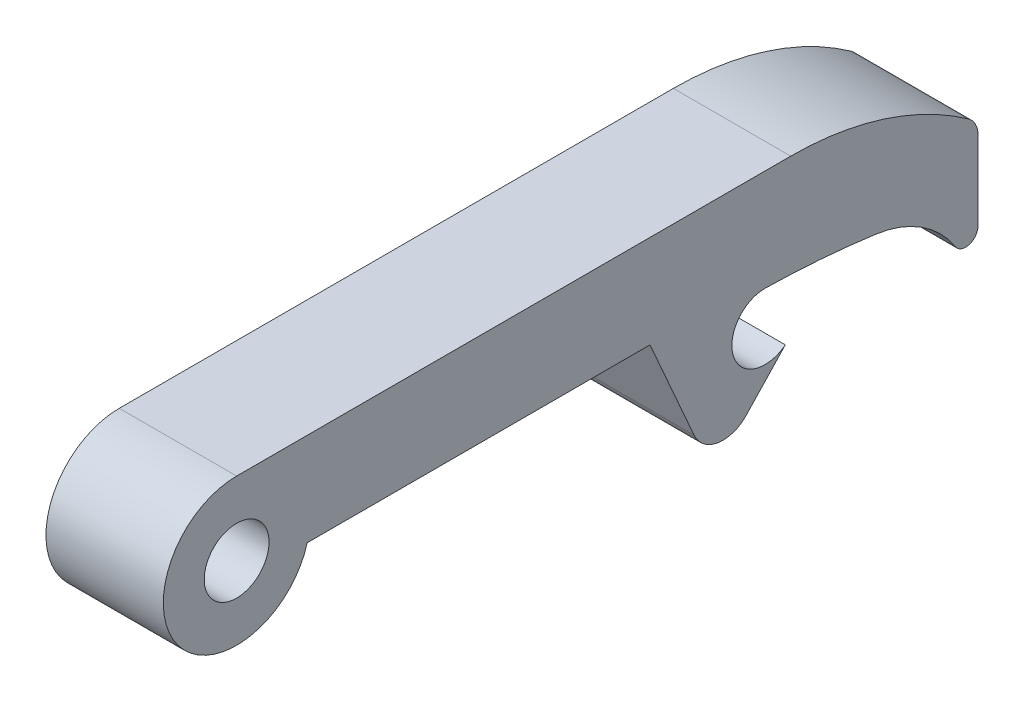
ISO-10303-21;
HEADER;
FILE_DESCRIPTION(('STEP AP214'),'2;1');
FILE_NAME('part.step','',(''),(''),'','','');
FILE_SCHEMA(('AUTOMOTIVE_DESIGN { 1 0 10303 214 1 1 1 1 }'));
ENDSEC;
DATA;
#1=APPLICATION_CONTEXT('core data for automotive mechanical design processes');
#2=APPLICATION_PROTOCOL_DEFINITION('international standard','automotive_design',2000,#1);
#3=PRODUCT_CONTEXT('',#1,'mechanical');
#4=PRODUCT('Part','Part','',(#3));
#5=PRODUCT_RELATED_PRODUCT_CATEGORY('part','',(#4));
#6=PRODUCT_DEFINITION_FORMATION('','',#4);
#7=PRODUCT_DEFINITION_CONTEXT('part definition',#1,'design');
#8=PRODUCT_DEFINITION('design','',#6,#7);
#9=PRODUCT_DEFINITION_SHAPE('','',#8);
#10=(LENGTH_UNIT() NAMED_UNIT(*) SI_UNIT(.MILLI.,.METRE.));
#11=(NAMED_UNIT(*) PLANE_ANGLE_UNIT() SI_UNIT($,.RADIAN.));
#12=(NAMED_UNIT(*) SI_UNIT($,.STERADIAN.) SOLID_ANGLE_UNIT());
#13=UNCERTAINTY_MEASURE_WITH_UNIT(LENGTH_MEASURE(1.E-05),#10,'distance_accuracy_value','');
#14=(GEOMETRIC_REPRESENTATION_CONTEXT(3) GLOBAL_UNCERTAINTY_ASSIGNED_CONTEXT((#13)) GLOBAL_UNIT_ASSIGNED_CONTEXT((#10,
#11,#12)) REPRESENTATION_CONTEXT('',''));
#15=CARTESIAN_POINT('',(0.,0.,0.));
#16=DIRECTION('',(0.,0.,1.));
#17=DIRECTION('',(1.,0.,0.));
#18=AXIS2_PLACEMENT_3D('',#15,#16,#17);
#19=CARTESIAN_POINT('',(31.75,-18.2904528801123,286.195239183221));
#20=DIRECTION('',(-1.,0.,0.));
#21=DIRECTION('',(0.,0.,1.));
#22=AXIS2_PLACEMENT_3D('',#19,#20,#21);
#23=CYLINDRICAL_SURFACE('',#22,39.6691923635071);
#24=CARTESIAN_POINT('',(-31.75,-18.2904528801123,286.195239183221));
#25=DIRECTION('',(1.,0.,0.));
#26=DIRECTION('',(0.,0.,-1.));
#27=AXIS2_PLACEMENT_3D('',#24,#25,#26);
#28=CIRCLE('',#27,39.6691923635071);
#29=CARTESIAN_POINT('',(-31.75,21.3787394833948,286.195239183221));
#30=VERTEX_POINT('',#29);
#31=CARTESIAN_POINT('',(-31.75,-28.9798226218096,247.99337800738));
#32=VERTEX_POINT('',#31);
#33=EDGE_CURVE('E127',#30,#32,#28,.T.);
#34=ORIENTED_EDGE('',*,*,#33,.T.);
#35=DIRECTION('',(-1.,0.,0.));
#36=VECTOR('',#35,1.);
#37=CARTESIAN_POINT('',(31.75,-28.9798226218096,247.99337800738));
#38=LINE('',#37,#36);
#39=CARTESIAN_POINT('',(31.75,-28.9798226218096,247.99337800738));
#40=VERTEX_POINT('',#39);
#41=EDGE_CURVE('E11',#40,#32,#38,.T.);
#42=ORIENTED_EDGE('',*,*,#41,.F.);
#43=CARTESIAN_POINT('',(31.75,-18.2904528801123,286.195239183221));
#44=DIRECTION('',(1.,0.,0.));
#45=DIRECTION('',(0.,0.,-1.));
#46=AXIS2_PLACEMENT_3D('',#43,#44,#45);
#47=CIRCLE('',#46,39.6691923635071);
#48=CARTESIAN_POINT('',(31.75,21.3787394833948,286.195239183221));
#49=VERTEX_POINT('',#48);
#50=EDGE_CURVE('E169',#49,#40,#47,.T.);
#51=ORIENTED_EDGE('',*,*,#50,.F.);
#52=DIRECTION('',(-1.,0.,0.));
#53=VECTOR('',#52,1.);
#54=CARTESIAN_POINT('',(31.75,21.3787394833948,286.195239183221));
#55=LINE('',#54,#53);
#56=EDGE_CURVE('E140',#49,#30,#55,.T.);
#57=ORIENTED_EDGE('',*,*,#56,.T.);
#58=EDGE_LOOP('',(#34,#42,#51,#57));
#59=FACE_BOUND('',#58,.T.);
#60=ADVANCED_FACE('F29',(#59),#23,.T.);
#61=CARTESIAN_POINT('',(31.75,-28.9798226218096,62.5236476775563));
#62=DIRECTION('',(0.,1.,0.));
#63=DIRECTION('',(0.,0.,1.));
#64=AXIS2_PLACEMENT_3D('',#61,#62,#63);
#65=PLANE('',#64);
#66=DIRECTION('',(0.,0.,-1.));
#67=VECTOR('',#66,1.);
#68=CARTESIAN_POINT('',(-31.75,-28.9798226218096,62.5236476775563));
#69=LINE('',#68,#67);
#70=CARTESIAN_POINT('',(-31.75,-28.9798226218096,62.5236476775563));
#71=VERTEX_POINT('',#70);
#72=EDGE_CURVE('E123',#32,#71,#69,.T.);
#73=ORIENTED_EDGE('',*,*,#72,.T.);
#74=DIRECTION('',(-1.,0.,0.));
#75=VECTOR('',#74,1.);
#76=CARTESIAN_POINT('',(31.75,-28.9798226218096,62.5236476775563));
#77=LINE('',#76,#75);
#78=CARTESIAN_POINT('',(31.75,-28.9798226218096,62.5236476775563));
#79=VERTEX_POINT('',#78);
#80=EDGE_CURVE('E36',#79,#71,#77,.T.);
#81=ORIENTED_EDGE('',*,*,#80,.F.);
#82=DIRECTION('',(0.,0.,-1.));
#83=VECTOR('',#82,1.);
#84=CARTESIAN_POINT('',(31.75,-28.9798226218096,62.5236476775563));
#85=LINE('',#84,#83);
#86=EDGE_CURVE('E136',#40,#79,#85,.T.);
#87=ORIENTED_EDGE('',*,*,#86,.F.);
#88=ORIENTED_EDGE('',*,*,#41,.T.);
#89=EDGE_LOOP('',(#73,#81,#87,#88));
#90=FACE_BOUND('',#89,.T.);
#91=ADVANCED_FACE('F135',(#90),#65,.F.);
#92=CARTESIAN_POINT('',(31.75,-83.2179374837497,38.6844172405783));
#93=DIRECTION('',(0.,0.40237741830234,-0.9154738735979));
#94=DIRECTION('',(0.,0.9154738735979,0.40237741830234));
#95=AXIS2_PLACEMENT_3D('',#92,#93,#94);
#96=PLANE('',#95);
#97=DIRECTION('',(0.,-0.9154738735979,-0.40237741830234));
#98=VECTOR('',#97,1.);
#99=CARTESIAN_POINT('',(-31.75,-83.2179374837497,38.6844172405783));
#100=LINE('',#99,#98);
#101=CARTESIAN_POINT('',(-31.75,-83.2179374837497,38.6844172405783));
#102=VERTEX_POINT('',#101);
#103=EDGE_CURVE('E129',#71,#102,#100,.T.);
#104=ORIENTED_EDGE('',*,*,#103,.T.);
#105=DIRECTION('',(-1.,0.,0.));
#106=VECTOR('',#105,1.);
#107=CARTESIAN_POINT('',(31.75,-83.2179374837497,38.6844172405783));
#108=LINE('',#107,#106);
#109=CARTESIAN_POINT('',(31.75,-83.2179374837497,38.6844172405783));
#110=VERTEX_POINT('',#109);
#111=EDGE_CURVE('E220',#110,#102,#108,.T.);
#112=ORIENTED_EDGE('',*,*,#111,.F.);
#113=DIRECTION('',(0.,-0.9154738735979,-0.40237741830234));
#114=VECTOR('',#113,1.);
#115=CARTESIAN_POINT('',(31.75,-83.2179374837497,38.6844172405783));
#116=LINE('',#115,#114);
#117=EDGE_CURVE('E172',#79,#110,#116,.T.);
#118=ORIENTED_EDGE('',*,*,#117,.F.);
#119=ORIENTED_EDGE('',*,*,#80,.T.);
#120=EDGE_LOOP('',(#104,#112,#118,#119));
#121=FACE_BOUND('',#120,.T.);
#122=ADVANCED_FACE('F224',(#121),#96,.F.);
#123=CARTESIAN_POINT('',(31.75,-76.3212880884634,22.9934215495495));
#124=DIRECTION('',(-1.,0.,0.));
#125=DIRECTION('',(0.,0.,1.));
#126=AXIS2_PLACEMENT_3D('',#123,#124,#125);
#127=CYLINDRICAL_SURFACE('',#126,17.1397525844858);
#128=CARTESIAN_POINT('',(-31.75,-76.3212880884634,22.9934215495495));
#129=DIRECTION('',(1.,0.,0.));
#130=DIRECTION('',(0.,0.,1.));
#131=AXIS2_PLACEMENT_3D('',#128,#129,#130);
#132=CIRCLE('',#131,17.1397525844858);
#133=CARTESIAN_POINT('',(-31.75,-88.0789591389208,10.5223233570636));
#134=VERTEX_POINT('',#133);
#135=EDGE_CURVE('E149',#102,#134,#132,.T.);
#136=ORIENTED_EDGE('',*,*,#135,.T.);
#137=DIRECTION('',(-1.,0.,0.));
#138=VECTOR('',#137,1.);
#139=CARTESIAN_POINT('',(31.75,-88.0789591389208,10.5223233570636));
#140=LINE('',#139,#138);
#141=CARTESIAN_POINT('',(31.75,-88.0789591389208,10.5223233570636));
#142=VERTEX_POINT('',#141);
#143=EDGE_CURVE('E217',#142,#134,#140,.T.);
#144=ORIENTED_EDGE('',*,*,#143,.F.);
#145=CARTESIAN_POINT('',(31.75,-76.3212880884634,22.9934215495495));
#146=DIRECTION('',(1.,0.,0.));
#147=DIRECTION('',(0.,0.,1.));
#148=AXIS2_PLACEMENT_3D('',#145,#146,#147);
#149=CIRCLE('',#148,17.1397525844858);
#150=EDGE_CURVE('E174',#110,#142,#149,.T.);
#151=ORIENTED_EDGE('',*,*,#150,.F.);
#152=ORIENTED_EDGE('',*,*,#111,.T.);
#153=EDGE_LOOP('',(#136,#144,#151,#152));
#154=FACE_BOUND('',#153,.T.);
#155=ADVANCED_FACE('F232',(#154),#127,.T.);
#156=CARTESIAN_POINT('',(31.75,-65.5801916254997,-10.6893697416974));
#157=DIRECTION('',(0.,0.685988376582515,0.727612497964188));
#158=DIRECTION('',(0.,-0.727612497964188,0.685988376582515));
#159=AXIS2_PLACEMENT_3D('',#156,#157,#158);
#160=PLANE('',#159);
#161=DIRECTION('',(0.,0.727612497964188,-0.685988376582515));
#162=VECTOR('',#161,1.);
#163=CARTESIAN_POINT('',(-31.75,-65.5801916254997,-10.6893697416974));
#164=LINE('',#163,#162);
#165=CARTESIAN_POINT('',(-31.75,-65.5801916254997,-10.6893697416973));
#166=VERTEX_POINT('',#165);
#167=EDGE_CURVE('E151',#134,#166,#164,.T.);
#168=ORIENTED_EDGE('',*,*,#167,.T.);
#169=DIRECTION('',(-1.,0.,0.));
#170=VECTOR('',#169,1.);
#171=CARTESIAN_POINT('',(31.75,-65.5801916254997,-10.6893697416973));
#172=LINE('',#171,#170);
#173=CARTESIAN_POINT('',(31.75,-65.5801916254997,-10.6893697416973));
#174=VERTEX_POINT('',#173);
#175=EDGE_CURVE('E214',#174,#166,#172,.T.);
#176=ORIENTED_EDGE('',*,*,#175,.F.);
#177=DIRECTION('',(0.,0.727612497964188,-0.685988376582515));
#178=VECTOR('',#177,1.);
#179=CARTESIAN_POINT('',(31.75,-65.5801916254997,-10.6893697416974));
#180=LINE('',#179,#178);
#181=EDGE_CURVE('E176',#142,#174,#180,.T.);
#182=ORIENTED_EDGE('',*,*,#181,.F.);
#183=ORIENTED_EDGE('',*,*,#143,.T.);
#184=EDGE_LOOP('',(#168,#176,#182,#183));
#185=FACE_BOUND('',#184,.T.);
#186=ADVANCED_FACE('F235',(#185),#160,.F.);
#187=CARTESIAN_POINT('',(31.75,-51.4973439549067,0.329066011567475));
#188=DIRECTION('',(-1.,0.,0.));
#189=DIRECTION('',(0.,0.,1.));
#190=AXIS2_PLACEMENT_3D('',#187,#188,#189);
#191=CYLINDRICAL_SURFACE('',#190,17.8810661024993);
#192=CARTESIAN_POINT('',(-31.75,-51.4973439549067,0.329066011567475));
#193=DIRECTION('',(-1.,0.,0.));
#194=DIRECTION('',(0.,0.,-1.));
#195=AXIS2_PLACEMENT_3D('',#192,#193,#194);
#196=CIRCLE('',#195,17.8810661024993);
#197=CARTESIAN_POINT('',(-31.75,-33.6193060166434,0.));
#198=VERTEX_POINT('',#197);
#199=EDGE_CURVE('E153',#166,#198,#196,.T.);
#200=ORIENTED_EDGE('',*,*,#199,.T.);
#201=DIRECTION('',(-1.,0.,0.));
#202=VECTOR('',#201,1.);
#203=CARTESIAN_POINT('',(31.75,-33.6193060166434,0.));
#204=LINE('',#203,#202);
#205=CARTESIAN_POINT('',(31.75,-33.6193060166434,0.));
#206=VERTEX_POINT('',#205);
#207=EDGE_CURVE('E211',#206,#198,#204,.T.);
#208=ORIENTED_EDGE('',*,*,#207,.F.);
#209=CARTESIAN_POINT('',(31.75,-51.4973439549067,0.329066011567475));
#210=DIRECTION('',(-1.,0.,0.));
#211=DIRECTION('',(0.,0.,-1.));
#212=AXIS2_PLACEMENT_3D('',#209,#210,#211);
#213=CIRCLE('',#212,17.8810661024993);
#214=EDGE_CURVE('E178',#174,#206,#213,.T.);
#215=ORIENTED_EDGE('',*,*,#214,.F.);
#216=ORIENTED_EDGE('',*,*,#175,.T.);
#217=EDGE_LOOP('',(#200,#208,#215,#216));
#218=FACE_BOUND('',#217,.T.);
#219=ADVANCED_FACE('F240',(#218),#191,.F.);
#220=CARTESIAN_POINT('',(31.75,-541.879675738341,9.35512125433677));
#221=DIRECTION('',(-1.,0.,0.));
#222=DIRECTION('',(0.,0.,1.));
#223=AXIS2_PLACEMENT_3D('',#220,#221,#222);
#224=CYLINDRICAL_SURFACE('',#223,508.346458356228);
#225=CARTESIAN_POINT('',(-31.75,-541.879675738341,9.35512125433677));
#226=DIRECTION('',(-1.,0.,0.));
#227=DIRECTION('',(0.,0.,-1.));
#228=AXIS2_PLACEMENT_3D('',#225,#226,#227);
#229=CIRCLE('',#228,508.346458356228);
#230=CARTESIAN_POINT('',(-31.75,-38.2587894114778,-59.7977859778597));
#231=VERTEX_POINT('',#230);
#232=EDGE_CURVE('E155',#198,#231,#229,.T.);
#233=ORIENTED_EDGE('',*,*,#232,.T.);
#234=DIRECTION('',(-1.,0.,0.));
#235=VECTOR('',#234,1.);
#236=CARTESIAN_POINT('',(31.75,-38.2587894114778,-59.7977859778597));
#237=LINE('',#236,#235);
#238=CARTESIAN_POINT('',(31.75,-38.2587894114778,-59.7977859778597));
#239=VERTEX_POINT('',#238);
#240=EDGE_CURVE('E208',#239,#231,#237,.T.);
#241=ORIENTED_EDGE('',*,*,#240,.F.);
#242=CARTESIAN_POINT('',(31.75,-541.879675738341,9.35512125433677));
#243=DIRECTION('',(-1.,0.,0.));
#244=DIRECTION('',(0.,0.,-1.));
#245=AXIS2_PLACEMENT_3D('',#242,#243,#244);
#246=CIRCLE('',#245,508.346458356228);
#247=EDGE_CURVE('E180',#206,#239,#246,.T.);
#248=ORIENTED_EDGE('',*,*,#247,.F.);
#249=ORIENTED_EDGE('',*,*,#207,.T.);
#250=EDGE_LOOP('',(#233,#241,#248,#249));
#251=FACE_BOUND('',#250,.T.);
#252=ADVANCED_FACE('F246',(#251),#224,.F.);
#253=CARTESIAN_POINT('',(31.75,-98.6662997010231,-51.503143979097));
#254=DIRECTION('',(-1.,0.,0.));
#255=DIRECTION('',(0.,0.,1.));
#256=AXIS2_PLACEMENT_3D('',#253,#254,#255);
#257=CYLINDRICAL_SURFACE('',#256,60.9743256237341);
#258=CARTESIAN_POINT('',(-31.75,-98.6662997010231,-51.503143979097));
#259=DIRECTION('',(-1.,0.,0.));
#260=DIRECTION('',(0.,0.,-1.));
#261=AXIS2_PLACEMENT_3D('',#258,#259,#260);
#262=CIRCLE('',#261,60.9743256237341);
#263=CARTESIAN_POINT('',(-31.75,-65.5801916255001,-102.720112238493));
#264=VERTEX_POINT('',#263);
#265=EDGE_CURVE('E157',#231,#264,#262,.T.);
#266=ORIENTED_EDGE('',*,*,#265,.T.);
#267=DIRECTION('',(-1.,0.,0.));
#268=VECTOR('',#267,1.);
#269=CARTESIAN_POINT('',(31.75,-65.5801916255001,-102.720112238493));
#270=LINE('',#269,#268);
#271=CARTESIAN_POINT('',(31.75,-65.5801916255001,-102.720112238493));
#272=VERTEX_POINT('',#271);
#273=EDGE_CURVE('E205',#272,#264,#270,.T.);
#274=ORIENTED_EDGE('',*,*,#273,.F.);
#275=CARTESIAN_POINT('',(31.75,-98.6662997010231,-51.503143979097));
#276=DIRECTION('',(-1.,0.,0.));
#277=DIRECTION('',(0.,0.,-1.));
#278=AXIS2_PLACEMENT_3D('',#275,#276,#277);
#279=CIRCLE('',#278,60.9743256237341);
#280=EDGE_CURVE('E182',#239,#272,#279,.T.);
#281=ORIENTED_EDGE('',*,*,#280,.F.);
#282=ORIENTED_EDGE('',*,*,#240,.T.);
#283=EDGE_LOOP('',(#266,#274,#281,#282));
#284=FACE_BOUND('',#283,.T.);
#285=ADVANCED_FACE('F250',(#284),#257,.F.);
#286=CARTESIAN_POINT('',(31.75,-61.9717045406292,-108.306014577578));
#287=DIRECTION('',(-1.,0.,0.));
#288=DIRECTION('',(0.,0.,1.));
#289=AXIS2_PLACEMENT_3D('',#286,#287,#288);
#290=CYLINDRICAL_SURFACE('',#289,6.65007398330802);
#291=CARTESIAN_POINT('',(-31.75,-61.9717045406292,-108.306014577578));
#292=DIRECTION('',(1.,0.,0.));
#293=DIRECTION('',(0.,0.,1.));
#294=AXIS2_PLACEMENT_3D('',#291,#292,#293);
#295=CIRCLE('',#294,6.65007398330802);
#296=CARTESIAN_POINT('',(-31.75,-61.9717045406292,-114.956088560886));
#297=VERTEX_POINT('',#296);
#298=EDGE_CURVE('E159',#264,#297,#295,.T.);
#299=ORIENTED_EDGE('',*,*,#298,.T.);
#300=DIRECTION('',(-1.,0.,0.));
#301=VECTOR('',#300,1.);
#302=CARTESIAN_POINT('',(31.75,-61.9717045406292,-114.956088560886));
#303=LINE('',#302,#301);
#304=CARTESIAN_POINT('',(31.75,-61.9717045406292,-114.956088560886));
#305=VERTEX_POINT('',#304);
#306=EDGE_CURVE('E202',#305,#297,#303,.T.);
#307=ORIENTED_EDGE('',*,*,#306,.F.);
#308=CARTESIAN_POINT('',(31.75,-61.9717045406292,-108.306014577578));
#309=DIRECTION('',(1.,0.,0.));
#310=DIRECTION('',(0.,0.,1.));
#311=AXIS2_PLACEMENT_3D('',#308,#309,#310);
#312=CIRCLE('',#311,6.65007398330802);
#313=EDGE_CURVE('E184',#272,#305,#312,.T.);
#314=ORIENTED_EDGE('',*,*,#313,.F.);
#315=ORIENTED_EDGE('',*,*,#273,.T.);
#316=EDGE_LOOP('',(#299,#307,#314,#315));
#317=FACE_BOUND('',#316,.T.);
#318=ADVANCED_FACE('F255',(#317),#290,.T.);
#319=CARTESIAN_POINT('',(31.75,-19.2578760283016,-114.956088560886));
#320=DIRECTION('',(0.,0.,1.));
#321=DIRECTION('',(0.,-1.,0.));
#322=AXIS2_PLACEMENT_3D('',#319,#320,#321);
#323=PLANE('',#322);
#324=DIRECTION('',(0.,1.,0.));
#325=VECTOR('',#324,1.);
#326=CARTESIAN_POINT('',(-31.75,-19.2578760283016,-114.956088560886));
#327=LINE('',#326,#325);
#328=CARTESIAN_POINT('',(-31.75,-19.2578760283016,-114.956088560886));
#329=VERTEX_POINT('',#328);
#330=EDGE_CURVE('E161',#297,#329,#327,.T.);
#331=ORIENTED_EDGE('',*,*,#330,.T.);
#332=DIRECTION('',(-1.,0.,0.));
#333=VECTOR('',#332,1.);
#334=CARTESIAN_POINT('',(31.75,-19.2578760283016,-114.956088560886));
#335=LINE('',#334,#333);
#336=CARTESIAN_POINT('',(31.75,-19.2578760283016,-114.956088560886));
#337=VERTEX_POINT('',#336);
#338=EDGE_CURVE('E199',#337,#329,#335,.T.);
#339=ORIENTED_EDGE('',*,*,#338,.F.);
#340=DIRECTION('',(0.,1.,0.));
#341=VECTOR('',#340,1.);
#342=CARTESIAN_POINT('',(31.75,-19.2578760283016,-114.956088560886));
#343=LINE('',#342,#341);
#344=EDGE_CURVE('E186',#305,#337,#343,.T.);
#345=ORIENTED_EDGE('',*,*,#344,.F.);
#346=ORIENTED_EDGE('',*,*,#306,.T.);
#347=EDGE_LOOP('',(#331,#339,#345,#346));
#348=FACE_BOUND('',#347,.T.);
#349=ADVANCED_FACE('F261',(#348),#323,.F.);
#350=CARTESIAN_POINT('',(31.75,-19.2578760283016,-102.720112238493));
#351=DIRECTION('',(-1.,0.,0.));
#352=DIRECTION('',(0.,0.,1.));
#353=AXIS2_PLACEMENT_3D('',#350,#351,#352);
#354=CYLINDRICAL_SURFACE('',#353,12.2359763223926);
#355=CARTESIAN_POINT('',(-31.75,-19.2578760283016,-102.720112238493));
#356=DIRECTION('',(1.,0.,0.));
#357=DIRECTION('',(0.,0.,1.));
#358=AXIS2_PLACEMENT_3D('',#355,#356,#357);
#359=CIRCLE('',#358,12.2359763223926);
#360=CARTESIAN_POINT('',(-31.75,-9.27896678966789,-109.80110701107));
#361=VERTEX_POINT('',#360);
#362=EDGE_CURVE('E163',#329,#361,#359,.T.);
#363=ORIENTED_EDGE('',*,*,#362,.T.);
#364=DIRECTION('',(-1.,0.,0.));
#365=VECTOR('',#364,1.);
#366=CARTESIAN_POINT('',(31.75,-9.27896678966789,-109.80110701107));
#367=LINE('',#366,#365);
#368=CARTESIAN_POINT('',(31.75,-9.27896678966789,-109.80110701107));
#369=VERTEX_POINT('',#368);
#370=EDGE_CURVE('E196',#369,#361,#367,.T.);
#371=ORIENTED_EDGE('',*,*,#370,.F.);
#372=CARTESIAN_POINT('',(31.75,-19.2578760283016,-102.720112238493));
#373=DIRECTION('',(1.,0.,0.));
#374=DIRECTION('',(0.,0.,1.));
#375=AXIS2_PLACEMENT_3D('',#372,#373,#374);
#376=CIRCLE('',#375,12.2359763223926);
#377=EDGE_CURVE('E188',#337,#369,#376,.T.);
#378=ORIENTED_EDGE('',*,*,#377,.F.);
#379=ORIENTED_EDGE('',*,*,#338,.T.);
#380=EDGE_LOOP('',(#363,#371,#378,#379));
#381=FACE_BOUND('',#380,.T.);
#382=ADVANCED_FACE('F265',(#381),#354,.T.);
#383=CARTESIAN_POINT('',(31.75,-144.82233214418,-13.6200677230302));
#384=DIRECTION('',(-1.,0.,0.));
#385=DIRECTION('',(0.,0.,1.));
#386=AXIS2_PLACEMENT_3D('',#383,#384,#385);
#387=CYLINDRICAL_SURFACE('',#386,166.201071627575);
#388=CARTESIAN_POINT('',(-31.75,-144.82233214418,-13.6200677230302));
#389=DIRECTION('',(1.,0.,0.));
#390=DIRECTION('',(0.,0.,1.));
#391=AXIS2_PLACEMENT_3D('',#388,#389,#390);
#392=CIRCLE('',#391,166.201071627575);
#393=CARTESIAN_POINT('',(-31.75,21.3787394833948,-13.6200677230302));
#394=VERTEX_POINT('',#393);
#395=EDGE_CURVE('E165',#361,#394,#392,.T.);
#396=ORIENTED_EDGE('',*,*,#395,.T.);
#397=DIRECTION('',(-1.,0.,0.));
#398=VECTOR('',#397,1.);
#399=CARTESIAN_POINT('',(31.75,21.3787394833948,-13.6200677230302));
#400=LINE('',#399,#398);
#401=CARTESIAN_POINT('',(31.75,21.3787394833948,-13.6200677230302));
#402=VERTEX_POINT('',#401);
#403=EDGE_CURVE('E193',#402,#394,#400,.T.);
#404=ORIENTED_EDGE('',*,*,#403,.F.);
#405=CARTESIAN_POINT('',(31.75,-144.82233214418,-13.6200677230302));
#406=DIRECTION('',(1.,0.,0.));
#407=DIRECTION('',(0.,0.,1.));
#408=AXIS2_PLACEMENT_3D('',#405,#406,#407);
#409=CIRCLE('',#408,166.201071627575);
#410=EDGE_CURVE('E48',#369,#402,#409,.T.);
#411=ORIENTED_EDGE('',*,*,#410,.F.);
#412=ORIENTED_EDGE('',*,*,#370,.T.);
#413=EDGE_LOOP('',(#396,#404,#411,#412));
#414=FACE_BOUND('',#413,.T.);
#415=ADVANCED_FACE('F268',(#414),#387,.T.);
#416=CARTESIAN_POINT('',(31.75,21.3787394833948,286.195239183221));
#417=DIRECTION('',(0.,-1.,0.));
#418=DIRECTION('',(0.,0.,-1.));
#419=AXIS2_PLACEMENT_3D('',#416,#417,#418);
#420=PLANE('',#419);
#421=DIRECTION('',(0.,0.,1.));
#422=VECTOR('',#421,1.);
#423=CARTESIAN_POINT('',(-31.75,21.3787394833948,286.195239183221));
#424=LINE('',#423,#422);
#425=EDGE_CURVE('E167',#394,#30,#424,.T.);
#426=ORIENTED_EDGE('',*,*,#425,.T.);
#427=ORIENTED_EDGE('',*,*,#56,.F.);
#428=DIRECTION('',(0.,0.,1.));
#429=VECTOR('',#428,1.);
#430=CARTESIAN_POINT('',(31.75,21.3787394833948,286.195239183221));
#431=LINE('',#430,#429);
#432=EDGE_CURVE('E43',#402,#49,#431,.T.);
#433=ORIENTED_EDGE('',*,*,#432,.F.);
#434=ORIENTED_EDGE('',*,*,#403,.T.);
#435=EDGE_LOOP('',(#426,#427,#433,#434));
#436=FACE_BOUND('',#435,.T.);
#437=ADVANCED_FACE('F270',(#436),#420,.F.);
#438=CARTESIAN_POINT('',(31.75,-18.2904528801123,286.195239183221));
#439=DIRECTION('',(1.,0.,0.));
#440=DIRECTION('',(0.,0.,-1.));
#441=AXIS2_PLACEMENT_3D('',#438,#439,#440);
#442=PLANE('',#441);
#443=CARTESIAN_POINT('',(31.75,-18.2904528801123,286.195239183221));
#444=DIRECTION('',(1.,0.,0.));
#445=DIRECTION('',(0.,0.,-1.));
#446=AXIS2_PLACEMENT_3D('',#443,#444,#445);
#447=CIRCLE('',#446,17.5361696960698);
#448=CARTESIAN_POINT('',(31.75,-18.2904528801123,268.659069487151));
#449=VERTEX_POINT('',#448);
#450=EDGE_CURVE('E144',#449,#449,#447,.T.);
#451=ORIENTED_EDGE('',*,*,#450,.F.);
#452=EDGE_LOOP('',(#451));
#453=FACE_BOUND('',#452,.T.);
#454=ORIENTED_EDGE('',*,*,#50,.T.);
#455=ORIENTED_EDGE('',*,*,#86,.T.);
#456=ORIENTED_EDGE('',*,*,#117,.T.);
#457=ORIENTED_EDGE('',*,*,#150,.T.);
#458=ORIENTED_EDGE('',*,*,#181,.T.);
#459=ORIENTED_EDGE('',*,*,#214,.T.);
#460=ORIENTED_EDGE('',*,*,#247,.T.);
#461=ORIENTED_EDGE('',*,*,#280,.T.);
#462=ORIENTED_EDGE('',*,*,#313,.T.);
#463=ORIENTED_EDGE('',*,*,#344,.T.);
#464=ORIENTED_EDGE('',*,*,#377,.T.);
#465=ORIENTED_EDGE('',*,*,#410,.T.);
#466=ORIENTED_EDGE('',*,*,#432,.T.);
#467=EDGE_LOOP('',(#454,#455,#456,#457,#458,#459,#460,#461,#462,#463,#464,#465,#466));
#468=FACE_BOUND('',#467,.T.);
#469=ADVANCED_FACE('F227',(#453,#468),#442,.T.);
#470=CARTESIAN_POINT('',(-31.75,-18.2904528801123,286.195239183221));
#471=DIRECTION('',(1.,0.,0.));
#472=DIRECTION('',(0.,0.,-1.));
#473=AXIS2_PLACEMENT_3D('',#470,#471,#472);
#474=PLANE('',#473);
#475=CARTESIAN_POINT('',(-31.75,-18.2904528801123,286.195239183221));
#476=DIRECTION('',(1.,0.,0.));
#477=DIRECTION('',(0.,0.,-1.));
#478=AXIS2_PLACEMENT_3D('',#475,#476,#477);
#479=CIRCLE('',#478,17.5361696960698);
#480=CARTESIAN_POINT('',(-31.75,-18.2904528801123,268.659069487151));
#481=VERTEX_POINT('',#480);
#482=EDGE_CURVE('E141',#481,#481,#479,.T.);
#483=ORIENTED_EDGE('',*,*,#482,.T.);
#484=EDGE_LOOP('',(#483));
#485=FACE_BOUND('',#484,.T.);
#486=ORIENTED_EDGE('',*,*,#33,.F.);
#487=ORIENTED_EDGE('',*,*,#425,.F.);
#488=ORIENTED_EDGE('',*,*,#395,.F.);
#489=ORIENTED_EDGE('',*,*,#362,.F.);
#490=ORIENTED_EDGE('',*,*,#330,.F.);
#491=ORIENTED_EDGE('',*,*,#298,.F.);
#492=ORIENTED_EDGE('',*,*,#265,.F.);
#493=ORIENTED_EDGE('',*,*,#232,.F.);
#494=ORIENTED_EDGE('',*,*,#199,.F.);
#495=ORIENTED_EDGE('',*,*,#167,.F.);
#496=ORIENTED_EDGE('',*,*,#135,.F.);
#497=ORIENTED_EDGE('',*,*,#103,.F.);
#498=ORIENTED_EDGE('',*,*,#72,.F.);
#499=EDGE_LOOP('',(#486,#487,#488,#489,#490,#491,#492,#493,#494,#495,#496,#497,#498));
#500=FACE_BOUND('',#499,.T.);
#501=ADVANCED_FACE('F124',(#485,#500),#474,.F.);
#502=CARTESIAN_POINT('',(-31.75,-18.2904528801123,286.195239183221));
#503=DIRECTION('',(1.,0.,0.));
#504=DIRECTION('',(0.,0.,-1.));
#505=AXIS2_PLACEMENT_3D('',#502,#503,#504);
#506=CYLINDRICAL_SURFACE('',#505,17.5361696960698);
#507=ORIENTED_EDGE('',*,*,#482,.F.);
#508=EDGE_LOOP('',(#507));
#509=FACE_BOUND('',#508,.T.);
#510=ORIENTED_EDGE('',*,*,#450,.T.);
#511=EDGE_LOOP('',(#510));
#512=FACE_BOUND('',#511,.T.);
#513=ADVANCED_FACE('F331',(#509,#512),#506,.F.);
#514=CLOSED_SHELL('',(#60,#91,#122,#155,#186,#219,#252,#285,#318,#349,#382,#415,#437,#469,#501,#513));
#515=MANIFOLD_SOLID_BREP('B2',#514);
#516=ADVANCED_BREP_SHAPE_REPRESENTATION('',(#18,#515),#14);
#517=SHAPE_DEFINITION_REPRESENTATION(#9,#516);
ENDSEC;
END-ISO-10303-21;
